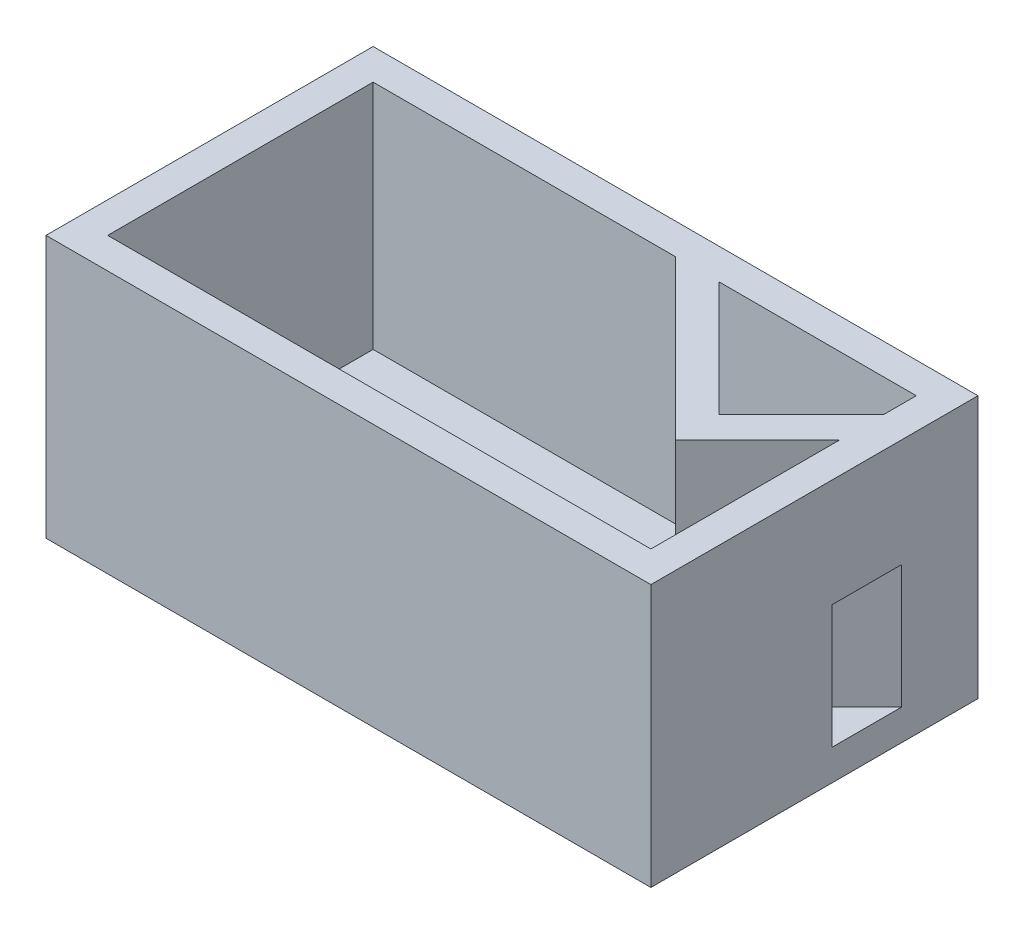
ISO-10303-21;
HEADER;
FILE_DESCRIPTION(('STEP AP214'),'2;1');
FILE_NAME('part.step','',(''),(''),'','','');
FILE_SCHEMA(('AUTOMOTIVE_DESIGN { 1 0 10303 214 1 1 1 1 }'));
ENDSEC;
DATA;
#1=APPLICATION_CONTEXT('core data for automotive mechanical design processes');
#2=APPLICATION_PROTOCOL_DEFINITION('international standard','automotive_design',2000,#1);
#3=PRODUCT_CONTEXT('',#1,'mechanical');
#4=PRODUCT('Part','Part','',(#3));
#5=PRODUCT_RELATED_PRODUCT_CATEGORY('part','',(#4));
#6=PRODUCT_DEFINITION_FORMATION('','',#4);
#7=PRODUCT_DEFINITION_CONTEXT('part definition',#1,'design');
#8=PRODUCT_DEFINITION('design','',#6,#7);
#9=PRODUCT_DEFINITION_SHAPE('','',#8);
#10=(LENGTH_UNIT() NAMED_UNIT(*) SI_UNIT(.MILLI.,.METRE.));
#11=(NAMED_UNIT(*) PLANE_ANGLE_UNIT() SI_UNIT($,.RADIAN.));
#12=(NAMED_UNIT(*) SI_UNIT($,.STERADIAN.) SOLID_ANGLE_UNIT());
#13=UNCERTAINTY_MEASURE_WITH_UNIT(LENGTH_MEASURE(1.E-05),#10,'distance_accuracy_value','');
#14=(GEOMETRIC_REPRESENTATION_CONTEXT(3) GLOBAL_UNCERTAINTY_ASSIGNED_CONTEXT((#13)) GLOBAL_UNIT_ASSIGNED_CONTEXT((#10,
#11,#12)) REPRESENTATION_CONTEXT('',''));
#15=CARTESIAN_POINT('',(0.,0.,0.));
#16=DIRECTION('',(0.,0.,1.));
#17=DIRECTION('',(1.,0.,0.));
#18=AXIS2_PLACEMENT_3D('',#15,#16,#17);
#19=CARTESIAN_POINT('',(4724.4,0.,2692.4));
#20=DIRECTION('',(-1.,0.,0.));
#21=DIRECTION('',(0.,0.,1.));
#22=AXIS2_PLACEMENT_3D('',#19,#20,#21);
#23=PLANE('',#22);
#24=DIRECTION('',(0.,-1.,0.));
#25=VECTOR('',#24,1.);
#26=CARTESIAN_POINT('',(4724.4,0.,882.591848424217));
#27=LINE('',#26,#25);
#28=CARTESIAN_POINT('',(4724.4,2159.,882.591848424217));
#29=VERTEX_POINT('',#28);
#30=CARTESIAN_POINT('',(4724.4,1270.,882.591848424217));
#31=VERTEX_POINT('',#30);
#32=EDGE_CURVE('E168',#29,#31,#27,.T.);
#33=ORIENTED_EDGE('',*,*,#32,.T.);
#34=DIRECTION('',(0.,0.,1.));
#35=VECTOR('',#34,1.);
#36=CARTESIAN_POINT('',(4724.4,1270.,2692.4));
#37=LINE('',#36,#35);
#38=CARTESIAN_POINT('',(4724.4,1270.,1457.32824017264));
#39=VERTEX_POINT('',#38);
#40=EDGE_CURVE('E159',#31,#39,#37,.T.);
#41=ORIENTED_EDGE('',*,*,#40,.T.);
#42=DIRECTION('',(0.,-1.,0.));
#43=VECTOR('',#42,1.);
#44=CARTESIAN_POINT('',(4724.4,2.69922264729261E-13,1457.32824017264));
#45=LINE('',#44,#43);
#46=CARTESIAN_POINT('',(4724.4,254.,1457.32824017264));
#47=VERTEX_POINT('',#46);
#48=EDGE_CURVE('E147',#39,#47,#45,.T.);
#49=ORIENTED_EDGE('',*,*,#48,.T.);
#50=DIRECTION('',(0.,0.,-1.));
#51=VECTOR('',#50,1.);
#52=CARTESIAN_POINT('',(4724.4,254.,2692.4));
#53=LINE('',#52,#51);
#54=CARTESIAN_POINT('',(4724.4,254.,2438.4));
#55=VERTEX_POINT('',#54);
#56=EDGE_CURVE('E212',#55,#47,#53,.T.);
#57=ORIENTED_EDGE('',*,*,#56,.F.);
#58=DIRECTION('',(0.,1.,0.));
#59=VECTOR('',#58,1.);
#60=CARTESIAN_POINT('',(4724.4,0.,2438.4));
#61=LINE('',#60,#59);
#62=CARTESIAN_POINT('',(4724.4,2159.,2438.4));
#63=VERTEX_POINT('',#62);
#64=EDGE_CURVE('E225',#55,#63,#61,.T.);
#65=ORIENTED_EDGE('',*,*,#64,.T.);
#66=DIRECTION('',(0.,0.,-1.));
#67=VECTOR('',#66,1.);
#68=CARTESIAN_POINT('',(4724.4,2159.,2692.4));
#69=LINE('',#68,#67);
#70=EDGE_CURVE('E238',#63,#29,#69,.T.);
#71=ORIENTED_EDGE('',*,*,#70,.T.);
#72=EDGE_LOOP('',(#33,#41,#49,#57,#65,#71));
#73=FACE_BOUND('',#72,.T.);
#74=ADVANCED_FACE('F32',(#73),#23,.T.);
#75=CARTESIAN_POINT('',(4978.4,0.,2692.4));
#76=DIRECTION('',(-1.,0.,0.));
#77=DIRECTION('',(0.,0.,1.));
#78=AXIS2_PLACEMENT_3D('',#75,#76,#77);
#79=PLANE('',#78);
#80=DIRECTION('',(0.,1.,0.));
#81=VECTOR('',#80,1.);
#82=CARTESIAN_POINT('',(4978.4,0.,0.));
#83=LINE('',#82,#81);
#84=CARTESIAN_POINT('',(4978.4,0.,0.));
#85=VERTEX_POINT('',#84);
#86=CARTESIAN_POINT('',(4978.4,2159.,0.));
#87=VERTEX_POINT('',#86);
#88=EDGE_CURVE('E256',#85,#87,#83,.T.);
#89=ORIENTED_EDGE('',*,*,#88,.T.);
#90=DIRECTION('',(0.,0.,-1.));
#91=VECTOR('',#90,1.);
#92=CARTESIAN_POINT('',(4978.4,2159.,2692.4));
#93=LINE('',#92,#91);
#94=CARTESIAN_POINT('',(4978.4,2159.,2692.4));
#95=VERTEX_POINT('',#94);
#96=EDGE_CURVE('E262',#95,#87,#93,.T.);
#97=ORIENTED_EDGE('',*,*,#96,.F.);
#98=DIRECTION('',(0.,1.,0.));
#99=VECTOR('',#98,1.);
#100=CARTESIAN_POINT('',(4978.4,0.,2692.4));
#101=LINE('',#100,#99);
#102=CARTESIAN_POINT('',(4978.4,0.,2692.4));
#103=VERTEX_POINT('',#102);
#104=EDGE_CURVE('E247',#103,#95,#101,.T.);
#105=ORIENTED_EDGE('',*,*,#104,.F.);
#106=DIRECTION('',(0.,0.,-1.));
#107=VECTOR('',#106,1.);
#108=CARTESIAN_POINT('',(4978.4,0.,2692.4));
#109=LINE('',#108,#107);
#110=EDGE_CURVE('E264',#103,#85,#109,.T.);
#111=ORIENTED_EDGE('',*,*,#110,.T.);
#112=EDGE_LOOP('',(#89,#97,#105,#111));
#113=FACE_BOUND('',#112,.T.);
#114=DIRECTION('',(0.,0.,-1.));
#115=VECTOR('',#114,1.);
#116=CARTESIAN_POINT('',(4978.4,254.,2692.4));
#117=LINE('',#116,#115);
#118=CARTESIAN_POINT('',(4978.4,254.,1203.32824017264));
#119=VERTEX_POINT('',#118);
#120=CARTESIAN_POINT('',(4978.4,254.,628.59184842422));
#121=VERTEX_POINT('',#120);
#122=EDGE_CURVE('E169',#119,#121,#117,.T.);
#123=ORIENTED_EDGE('',*,*,#122,.F.);
#124=DIRECTION('',(0.,-1.,0.));
#125=VECTOR('',#124,1.);
#126=CARTESIAN_POINT('',(4978.4,3.25433415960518E-13,1203.32824017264));
#127=LINE('',#126,#125);
#128=CARTESIAN_POINT('',(4978.4,1270.,1203.32824017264));
#129=VERTEX_POINT('',#128);
#130=EDGE_CURVE('E154',#129,#119,#127,.T.);
#131=ORIENTED_EDGE('',*,*,#130,.F.);
#132=DIRECTION('',(0.,0.,1.));
#133=VECTOR('',#132,1.);
#134=CARTESIAN_POINT('',(4978.4,1270.,2692.4));
#135=LINE('',#134,#133);
#136=CARTESIAN_POINT('',(4978.4,1270.,628.59184842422));
#137=VERTEX_POINT('',#136);
#138=EDGE_CURVE('E162',#137,#129,#135,.T.);
#139=ORIENTED_EDGE('',*,*,#138,.F.);
#140=DIRECTION('',(0.,1.,0.));
#141=VECTOR('',#140,1.);
#142=CARTESIAN_POINT('',(4978.4,0.,628.591848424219));
#143=LINE('',#142,#141);
#144=EDGE_CURVE('E172',#121,#137,#143,.T.);
#145=ORIENTED_EDGE('',*,*,#144,.F.);
#146=EDGE_LOOP('',(#123,#131,#139,#145));
#147=FACE_BOUND('',#146,.T.);
#148=ADVANCED_FACE('F305',(#113,#147),#79,.F.);
#149=CARTESIAN_POINT('',(0.,254.,2692.4));
#150=DIRECTION('',(0.,1.,0.));
#151=DIRECTION('',(0.,0.,1.));
#152=AXIS2_PLACEMENT_3D('',#149,#150,#151);
#153=PLANE('',#152);
#154=DIRECTION('',(-0.707106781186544,0.,-0.707106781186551));
#155=VECTOR('',#154,1.);
#156=CARTESIAN_POINT('',(2769.50256121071,254.,-77.1025612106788));
#157=LINE('',#156,#155);
#158=CARTESIAN_POINT('',(4047.19336300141,254.,1200.58824058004));
#159=VERTEX_POINT('',#158);
#160=CARTESIAN_POINT('',(3100.60512242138,254.,254.));
#161=VERTEX_POINT('',#160);
#162=EDGE_CURVE('E196',#159,#161,#157,.T.);
#163=ORIENTED_EDGE('',*,*,#162,.F.);
#164=DIRECTION('',(-0.707106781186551,0.,0.707106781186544));
#165=VECTOR('',#164,1.);
#166=CARTESIAN_POINT('',(1277.6908017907,254.,3970.09080179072));
#167=LINE('',#166,#165);
#168=CARTESIAN_POINT('',(4724.4,254.,523.381603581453));
#169=VERTEX_POINT('',#168);
#170=EDGE_CURVE('E11',#169,#159,#167,.T.);
#171=ORIENTED_EDGE('',*,*,#170,.F.);
#172=CARTESIAN_POINT('',(4724.4,254.,254.));
#173=VERTEX_POINT('',#172);
#174=EDGE_CURVE('E223',#169,#173,#53,.T.);
#175=ORIENTED_EDGE('',*,*,#174,.T.);
#176=DIRECTION('',(1.,0.,0.));
#177=VECTOR('',#176,1.);
#178=CARTESIAN_POINT('',(0.,254.,254.));
#179=LINE('',#178,#177);
#180=EDGE_CURVE('E207',#161,#173,#179,.T.);
#181=ORIENTED_EDGE('',*,*,#180,.F.);
#182=EDGE_LOOP('',(#163,#171,#175,#181));
#183=FACE_BOUND('',#182,.T.);
#184=ADVANCED_FACE('F322',(#183),#153,.T.);
#185=CARTESIAN_POINT('',(0.,0.,254.));
#186=DIRECTION('',(0.,0.,-1.));
#187=DIRECTION('',(-1.,0.,0.));
#188=AXIS2_PLACEMENT_3D('',#185,#186,#187);
#189=PLANE('',#188);
#190=DIRECTION('',(-1.,0.,0.));
#191=VECTOR('',#190,1.);
#192=CARTESIAN_POINT('',(0.,2159.,254.));
#193=LINE('',#192,#191);
#194=CARTESIAN_POINT('',(4724.4,2159.,254.));
#195=VERTEX_POINT('',#194);
#196=CARTESIAN_POINT('',(3100.60512242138,2159.,254.));
#197=VERTEX_POINT('',#196);
#198=EDGE_CURVE('E217',#195,#197,#193,.T.);
#199=ORIENTED_EDGE('',*,*,#198,.T.);
#200=DIRECTION('',(0.,-1.,0.));
#201=VECTOR('',#200,1.);
#202=CARTESIAN_POINT('',(3100.60512242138,0.,254.));
#203=LINE('',#202,#201);
#204=EDGE_CURVE('E273',#197,#161,#203,.T.);
#205=ORIENTED_EDGE('',*,*,#204,.T.);
#206=ORIENTED_EDGE('',*,*,#180,.T.);
#207=DIRECTION('',(0.,1.,0.));
#208=VECTOR('',#207,1.);
#209=CARTESIAN_POINT('',(4724.4,0.,254.));
#210=LINE('',#209,#208);
#211=EDGE_CURVE('E221',#173,#195,#210,.T.);
#212=ORIENTED_EDGE('',*,*,#211,.T.);
#213=EDGE_LOOP('',(#199,#205,#206,#212));
#214=FACE_BOUND('',#213,.T.);
#215=ADVANCED_FACE('F353',(#214),#189,.F.);
#216=CARTESIAN_POINT('',(0.,2159.,2692.4));
#217=DIRECTION('',(0.,-1.,0.));
#218=DIRECTION('',(0.,0.,-1.));
#219=AXIS2_PLACEMENT_3D('',#216,#217,#218);
#220=PLANE('',#219);
#221=CARTESIAN_POINT('',(4724.4,2159.,523.381603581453));
#222=VERTEX_POINT('',#221);
#223=EDGE_CURVE('E235',#222,#195,#69,.T.);
#224=ORIENTED_EDGE('',*,*,#223,.F.);
#225=DIRECTION('',(-0.707106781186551,0.,0.707106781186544));
#226=VECTOR('',#225,1.);
#227=CARTESIAN_POINT('',(3957.39080179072,2159.,1290.39080179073));
#228=LINE('',#227,#226);
#229=CARTESIAN_POINT('',(4047.19336300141,2159.,1200.58824058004));
#230=VERTEX_POINT('',#229);
#231=EDGE_CURVE('E182',#230,#222,#228,.F.);
#232=ORIENTED_EDGE('',*,*,#231,.F.);
#233=DIRECTION('',(-0.707106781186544,0.,-0.707106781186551));
#234=VECTOR('',#233,1.);
#235=CARTESIAN_POINT('',(3010.80256121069,2159.,164.197438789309));
#236=LINE('',#235,#234);
#237=EDGE_CURVE('E187',#197,#230,#236,.F.);
#238=ORIENTED_EDGE('',*,*,#237,.F.);
#239=ORIENTED_EDGE('',*,*,#198,.F.);
#240=EDGE_LOOP('',(#224,#232,#238,#239));
#241=FACE_BOUND('',#240,.T.);
#242=DIRECTION('',(-1.,0.,0.));
#243=VECTOR('',#242,1.);
#244=CARTESIAN_POINT('',(0.,2159.,0.));
#245=LINE('',#244,#243);
#246=CARTESIAN_POINT('',(0.,2159.,0.));
#247=VERTEX_POINT('',#246);
#248=EDGE_CURVE('E245',#87,#247,#245,.T.);
#249=ORIENTED_EDGE('',*,*,#248,.T.);
#250=DIRECTION('',(0.,0.,-1.));
#251=VECTOR('',#250,1.);
#252=CARTESIAN_POINT('',(0.,2159.,2692.4));
#253=LINE('',#252,#251);
#254=CARTESIAN_POINT('',(0.,2159.,2692.4));
#255=VERTEX_POINT('',#254);
#256=EDGE_CURVE('E251',#255,#247,#253,.T.);
#257=ORIENTED_EDGE('',*,*,#256,.F.);
#258=DIRECTION('',(-1.,0.,0.));
#259=VECTOR('',#258,1.);
#260=CARTESIAN_POINT('',(0.,2159.,2692.4));
#261=LINE('',#260,#259);
#262=EDGE_CURVE('E249',#95,#255,#261,.T.);
#263=ORIENTED_EDGE('',*,*,#262,.F.);
#264=ORIENTED_EDGE('',*,*,#96,.T.);
#265=EDGE_LOOP('',(#249,#257,#263,#264));
#266=FACE_BOUND('',#265,.T.);
#267=DIRECTION('',(-0.707106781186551,0.,0.707106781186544));
#268=VECTOR('',#267,1.);
#269=CARTESIAN_POINT('',(4136.9959242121,2159.,1469.99592421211));
#270=LINE('',#269,#268);
#271=CARTESIAN_POINT('',(4047.19336300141,2159.,1559.7984854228));
#272=VERTEX_POINT('',#271);
#273=EDGE_CURVE('E293',#272,#29,#270,.F.);
#274=ORIENTED_EDGE('',*,*,#273,.T.);
#275=ORIENTED_EDGE('',*,*,#70,.F.);
#276=DIRECTION('',(-1.,0.,0.));
#277=VECTOR('',#276,1.);
#278=CARTESIAN_POINT('',(0.,2159.,2438.4));
#279=LINE('',#278,#277);
#280=CARTESIAN_POINT('',(254.,2159.,2438.4));
#281=VERTEX_POINT('',#280);
#282=EDGE_CURVE('E231',#63,#281,#279,.T.);
#283=ORIENTED_EDGE('',*,*,#282,.T.);
#284=DIRECTION('',(0.,0.,-1.));
#285=VECTOR('',#284,1.);
#286=CARTESIAN_POINT('',(254.,2159.,2692.4));
#287=LINE('',#286,#285);
#288=CARTESIAN_POINT('',(254.,2159.,254.));
#289=VERTEX_POINT('',#288);
#290=EDGE_CURVE('E232',#281,#289,#287,.T.);
#291=ORIENTED_EDGE('',*,*,#290,.T.);
#292=CARTESIAN_POINT('',(2741.39487757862,2159.,254.));
#293=VERTEX_POINT('',#292);
#294=EDGE_CURVE('E228',#293,#289,#193,.T.);
#295=ORIENTED_EDGE('',*,*,#294,.F.);
#296=DIRECTION('',(-0.707106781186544,0.,-0.707106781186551));
#297=VECTOR('',#296,1.);
#298=CARTESIAN_POINT('',(2831.19743878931,2159.,343.802561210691));
#299=LINE('',#298,#297);
#300=EDGE_CURVE('E183',#293,#272,#299,.F.);
#301=ORIENTED_EDGE('',*,*,#300,.T.);
#302=EDGE_LOOP('',(#274,#275,#283,#291,#295,#301));
#303=FACE_BOUND('',#302,.T.);
#304=ADVANCED_FACE('F310',(#241,#266,#303),#220,.F.);
#305=CARTESIAN_POINT('',(0.,0.,2692.4));
#306=DIRECTION('',(1.,0.,0.));
#307=DIRECTION('',(0.,0.,-1.));
#308=AXIS2_PLACEMENT_3D('',#305,#306,#307);
#309=PLANE('',#308);
#310=DIRECTION('',(0.,-1.,0.));
#311=VECTOR('',#310,1.);
#312=CARTESIAN_POINT('',(0.,0.,0.));
#313=LINE('',#312,#311);
#314=CARTESIAN_POINT('',(0.,0.,0.));
#315=VERTEX_POINT('',#314);
#316=EDGE_CURVE('E211',#247,#315,#313,.T.);
#317=ORIENTED_EDGE('',*,*,#316,.T.);
#318=DIRECTION('',(0.,0.,-1.));
#319=VECTOR('',#318,1.);
#320=CARTESIAN_POINT('',(0.,0.,2692.4));
#321=LINE('',#320,#319);
#322=CARTESIAN_POINT('',(0.,0.,2692.4));
#323=VERTEX_POINT('',#322);
#324=EDGE_CURVE('E267',#323,#315,#321,.T.);
#325=ORIENTED_EDGE('',*,*,#324,.F.);
#326=DIRECTION('',(0.,-1.,0.));
#327=VECTOR('',#326,1.);
#328=CARTESIAN_POINT('',(0.,0.,2692.4));
#329=LINE('',#328,#327);
#330=EDGE_CURVE('E241',#255,#323,#329,.T.);
#331=ORIENTED_EDGE('',*,*,#330,.F.);
#332=ORIENTED_EDGE('',*,*,#256,.T.);
#333=EDGE_LOOP('',(#317,#325,#331,#332));
#334=FACE_BOUND('',#333,.T.);
#335=ADVANCED_FACE('F34',(#334),#309,.F.);
#336=CARTESIAN_POINT('',(0.,0.,2692.4));
#337=DIRECTION('',(0.,1.,0.));
#338=DIRECTION('',(0.,0.,1.));
#339=AXIS2_PLACEMENT_3D('',#336,#337,#338);
#340=PLANE('',#339);
#341=DIRECTION('',(1.,0.,0.));
#342=VECTOR('',#341,1.);
#343=CARTESIAN_POINT('',(0.,0.,0.));
#344=LINE('',#343,#342);
#345=EDGE_CURVE('E254',#315,#85,#344,.T.);
#346=ORIENTED_EDGE('',*,*,#345,.T.);
#347=ORIENTED_EDGE('',*,*,#110,.F.);
#348=DIRECTION('',(1.,0.,0.));
#349=VECTOR('',#348,1.);
#350=CARTESIAN_POINT('',(0.,0.,2692.4));
#351=LINE('',#350,#349);
#352=EDGE_CURVE('E244',#323,#103,#351,.T.);
#353=ORIENTED_EDGE('',*,*,#352,.F.);
#354=ORIENTED_EDGE('',*,*,#324,.T.);
#355=EDGE_LOOP('',(#346,#347,#353,#354));
#356=FACE_BOUND('',#355,.T.);
#357=ADVANCED_FACE('F453',(#356),#340,.F.);
#358=CARTESIAN_POINT('',(0.,0.,2692.4));
#359=DIRECTION('',(0.,0.,-1.));
#360=DIRECTION('',(-1.,0.,0.));
#361=AXIS2_PLACEMENT_3D('',#358,#359,#360);
#362=PLANE('',#361);
#363=ORIENTED_EDGE('',*,*,#330,.T.);
#364=ORIENTED_EDGE('',*,*,#352,.T.);
#365=ORIENTED_EDGE('',*,*,#104,.T.);
#366=ORIENTED_EDGE('',*,*,#262,.T.);
#367=EDGE_LOOP('',(#363,#364,#365,#366));
#368=FACE_BOUND('',#367,.T.);
#369=ADVANCED_FACE('F323',(#368),#362,.F.);
#370=CARTESIAN_POINT('',(0.,0.,0.));
#371=DIRECTION('',(0.,0.,-1.));
#372=DIRECTION('',(-1.,0.,0.));
#373=AXIS2_PLACEMENT_3D('',#370,#371,#372);
#374=PLANE('',#373);
#375=ORIENTED_EDGE('',*,*,#316,.F.);
#376=ORIENTED_EDGE('',*,*,#248,.F.);
#377=ORIENTED_EDGE('',*,*,#88,.F.);
#378=ORIENTED_EDGE('',*,*,#345,.F.);
#379=EDGE_LOOP('',(#375,#376,#377,#378));
#380=FACE_BOUND('',#379,.T.);
#381=ADVANCED_FACE('F314',(#380),#374,.T.);
#382=CARTESIAN_POINT('',(254.,0.,2692.4));
#383=DIRECTION('',(1.,0.,0.));
#384=DIRECTION('',(0.,0.,-1.));
#385=AXIS2_PLACEMENT_3D('',#382,#383,#384);
#386=PLANE('',#385);
#387=DIRECTION('',(0.,-1.,0.));
#388=VECTOR('',#387,1.);
#389=CARTESIAN_POINT('',(254.,0.,254.));
#390=LINE('',#389,#388);
#391=CARTESIAN_POINT('',(254.,254.,254.));
#392=VERTEX_POINT('',#391);
#393=EDGE_CURVE('E204',#289,#392,#390,.T.);
#394=ORIENTED_EDGE('',*,*,#393,.F.);
#395=ORIENTED_EDGE('',*,*,#290,.F.);
#396=DIRECTION('',(0.,-1.,0.));
#397=VECTOR('',#396,1.);
#398=CARTESIAN_POINT('',(254.,0.,2438.4));
#399=LINE('',#398,#397);
#400=CARTESIAN_POINT('',(254.,254.,2438.4));
#401=VERTEX_POINT('',#400);
#402=EDGE_CURVE('E213',#281,#401,#399,.T.);
#403=ORIENTED_EDGE('',*,*,#402,.T.);
#404=DIRECTION('',(0.,0.,-1.));
#405=VECTOR('',#404,1.);
#406=CARTESIAN_POINT('',(254.,254.,2692.4));
#407=LINE('',#406,#405);
#408=EDGE_CURVE('E208',#401,#392,#407,.T.);
#409=ORIENTED_EDGE('',*,*,#408,.T.);
#410=EDGE_LOOP('',(#394,#395,#403,#409));
#411=FACE_BOUND('',#410,.T.);
#412=ADVANCED_FACE('F312',(#411),#386,.T.);
#413=ORIENTED_EDGE('',*,*,#56,.T.);
#414=DIRECTION('',(-0.707106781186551,0.,0.707106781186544));
#415=VECTOR('',#414,1.);
#416=CARTESIAN_POINT('',(5580.06412008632,254.,601.664120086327));
#417=LINE('',#416,#415);
#418=EDGE_CURVE('E52',#119,#47,#417,.T.);
#419=ORIENTED_EDGE('',*,*,#418,.F.);
#420=ORIENTED_EDGE('',*,*,#122,.T.);
#421=DIRECTION('',(-0.707106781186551,0.,0.707106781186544));
#422=VECTOR('',#421,1.);
#423=CARTESIAN_POINT('',(1457.29592421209,254.,4149.6959242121));
#424=LINE('',#423,#422);
#425=CARTESIAN_POINT('',(4047.19336300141,254.,1559.7984854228));
#426=VERTEX_POINT('',#425);
#427=EDGE_CURVE('E201',#121,#426,#424,.T.);
#428=ORIENTED_EDGE('',*,*,#427,.T.);
#429=DIRECTION('',(-0.707106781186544,0.,-0.707106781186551));
#430=VECTOR('',#429,1.);
#431=CARTESIAN_POINT('',(2589.89743878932,254.,102.502561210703));
#432=LINE('',#431,#430);
#433=CARTESIAN_POINT('',(2741.39487757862,254.,254.));
#434=VERTEX_POINT('',#433);
#435=EDGE_CURVE('E40',#426,#434,#432,.T.);
#436=ORIENTED_EDGE('',*,*,#435,.T.);
#437=EDGE_CURVE('E218',#392,#434,#179,.T.);
#438=ORIENTED_EDGE('',*,*,#437,.F.);
#439=ORIENTED_EDGE('',*,*,#408,.F.);
#440=DIRECTION('',(1.,0.,0.));
#441=VECTOR('',#440,1.);
#442=CARTESIAN_POINT('',(0.,254.,2438.4));
#443=LINE('',#442,#441);
#444=EDGE_CURVE('E216',#401,#55,#443,.T.);
#445=ORIENTED_EDGE('',*,*,#444,.T.);
#446=EDGE_LOOP('',(#413,#419,#420,#428,#436,#438,#439,#445));
#447=FACE_BOUND('',#446,.T.);
#448=ADVANCED_FACE('F280',(#447),#153,.T.);
#449=DIRECTION('',(0.,-1.,0.));
#450=VECTOR('',#449,1.);
#451=CARTESIAN_POINT('',(4724.4,0.,523.381603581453));
#452=LINE('',#451,#450);
#453=EDGE_CURVE('E276',#222,#169,#452,.T.);
#454=ORIENTED_EDGE('',*,*,#453,.F.);
#455=ORIENTED_EDGE('',*,*,#223,.T.);
#456=ORIENTED_EDGE('',*,*,#211,.F.);
#457=ORIENTED_EDGE('',*,*,#174,.F.);
#458=EDGE_LOOP('',(#454,#455,#456,#457));
#459=FACE_BOUND('',#458,.T.);
#460=ADVANCED_FACE('F320',(#459),#23,.T.);
#461=CARTESIAN_POINT('',(0.,0.,2438.4));
#462=DIRECTION('',(0.,0.,-1.));
#463=DIRECTION('',(-1.,0.,0.));
#464=AXIS2_PLACEMENT_3D('',#461,#462,#463);
#465=PLANE('',#464);
#466=ORIENTED_EDGE('',*,*,#402,.F.);
#467=ORIENTED_EDGE('',*,*,#282,.F.);
#468=ORIENTED_EDGE('',*,*,#64,.F.);
#469=ORIENTED_EDGE('',*,*,#444,.F.);
#470=EDGE_LOOP('',(#466,#467,#468,#469));
#471=FACE_BOUND('',#470,.T.);
#472=ADVANCED_FACE('F309',(#471),#465,.T.);
#473=ORIENTED_EDGE('',*,*,#437,.T.);
#474=DIRECTION('',(0.,1.,0.));
#475=VECTOR('',#474,1.);
#476=CARTESIAN_POINT('',(2741.39487757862,0.,254.));
#477=LINE('',#476,#475);
#478=EDGE_CURVE('E270',#434,#293,#477,.T.);
#479=ORIENTED_EDGE('',*,*,#478,.T.);
#480=ORIENTED_EDGE('',*,*,#294,.T.);
#481=ORIENTED_EDGE('',*,*,#393,.T.);
#482=EDGE_LOOP('',(#473,#479,#480,#481));
#483=FACE_BOUND('',#482,.T.);
#484=ADVANCED_FACE('F285',(#483),#189,.F.);
#485=CARTESIAN_POINT('',(3010.80256121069,2159.,164.197438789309));
#486=DIRECTION('',(0.707106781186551,0.,-0.707106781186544));
#487=DIRECTION('',(-0.707106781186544,0.,-0.707106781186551));
#488=AXIS2_PLACEMENT_3D('',#485,#486,#487);
#489=PLANE('',#488);
#490=DIRECTION('',(0.,-1.,0.));
#491=VECTOR('',#490,1.);
#492=CARTESIAN_POINT('',(4047.19336300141,2159.,1200.58824058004));
#493=LINE('',#492,#491);
#494=EDGE_CURVE('E179',#230,#159,#493,.T.);
#495=ORIENTED_EDGE('',*,*,#494,.T.);
#496=ORIENTED_EDGE('',*,*,#162,.T.);
#497=ORIENTED_EDGE('',*,*,#204,.F.);
#498=ORIENTED_EDGE('',*,*,#237,.T.);
#499=EDGE_LOOP('',(#495,#496,#497,#498));
#500=FACE_BOUND('',#499,.T.);
#501=ADVANCED_FACE('F357',(#500),#489,.T.);
#502=CARTESIAN_POINT('',(3957.39080179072,2159.,1290.39080179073));
#503=DIRECTION('',(-0.707106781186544,0.,-0.707106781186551));
#504=DIRECTION('',(-0.707106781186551,0.,0.707106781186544));
#505=AXIS2_PLACEMENT_3D('',#502,#503,#504);
#506=PLANE('',#505);
#507=ORIENTED_EDGE('',*,*,#231,.T.);
#508=ORIENTED_EDGE('',*,*,#453,.T.);
#509=ORIENTED_EDGE('',*,*,#170,.T.);
#510=ORIENTED_EDGE('',*,*,#494,.F.);
#511=EDGE_LOOP('',(#507,#508,#509,#510));
#512=FACE_BOUND('',#511,.T.);
#513=ADVANCED_FACE('F359',(#512),#506,.T.);
#514=CARTESIAN_POINT('',(2831.19743878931,2159.,343.802561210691));
#515=DIRECTION('',(-0.707106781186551,0.,0.707106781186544));
#516=DIRECTION('',(0.707106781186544,0.,0.707106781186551));
#517=AXIS2_PLACEMENT_3D('',#514,#515,#516);
#518=PLANE('',#517);
#519=ORIENTED_EDGE('',*,*,#478,.F.);
#520=ORIENTED_EDGE('',*,*,#435,.F.);
#521=DIRECTION('',(0.,-1.,0.));
#522=VECTOR('',#521,1.);
#523=CARTESIAN_POINT('',(4047.19336300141,2159.,1559.7984854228));
#524=LINE('',#523,#522);
#525=EDGE_CURVE('E153',#272,#426,#524,.T.);
#526=ORIENTED_EDGE('',*,*,#525,.F.);
#527=ORIENTED_EDGE('',*,*,#300,.F.);
#528=EDGE_LOOP('',(#519,#520,#526,#527));
#529=FACE_BOUND('',#528,.T.);
#530=ADVANCED_FACE('F288',(#529),#518,.T.);
#531=CARTESIAN_POINT('',(4136.9959242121,2159.,1469.99592421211));
#532=DIRECTION('',(-0.707106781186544,0.,-0.707106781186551));
#533=DIRECTION('',(-0.707106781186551,0.,0.707106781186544));
#534=AXIS2_PLACEMENT_3D('',#531,#532,#533);
#535=PLANE('',#534);
#536=ORIENTED_EDGE('',*,*,#427,.F.);
#537=ORIENTED_EDGE('',*,*,#144,.T.);
#538=DIRECTION('',(-0.707106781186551,0.,0.707106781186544));
#539=VECTOR('',#538,1.);
#540=CARTESIAN_POINT('',(5292.69592421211,1270.,314.295924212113));
#541=LINE('',#540,#539);
#542=EDGE_CURVE('E164',#137,#31,#541,.T.);
#543=ORIENTED_EDGE('',*,*,#542,.T.);
#544=ORIENTED_EDGE('',*,*,#32,.F.);
#545=ORIENTED_EDGE('',*,*,#273,.F.);
#546=ORIENTED_EDGE('',*,*,#525,.T.);
#547=EDGE_LOOP('',(#536,#537,#543,#544,#545,#546));
#548=FACE_BOUND('',#547,.T.);
#549=ADVANCED_FACE('F300',(#548),#535,.F.);
#550=CARTESIAN_POINT('',(5580.06412008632,1270.,601.664120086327));
#551=DIRECTION('',(-0.707106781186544,0.,-0.707106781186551));
#552=DIRECTION('',(-0.707106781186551,0.,0.707106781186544));
#553=AXIS2_PLACEMENT_3D('',#550,#551,#552);
#554=PLANE('',#553);
#555=DIRECTION('',(-0.707106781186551,0.,0.707106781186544));
#556=VECTOR('',#555,1.);
#557=CARTESIAN_POINT('',(5580.06412008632,1270.,601.664120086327));
#558=LINE('',#557,#556);
#559=EDGE_CURVE('E47',#129,#39,#558,.T.);
#560=ORIENTED_EDGE('',*,*,#559,.F.);
#561=ORIENTED_EDGE('',*,*,#130,.T.);
#562=ORIENTED_EDGE('',*,*,#418,.T.);
#563=ORIENTED_EDGE('',*,*,#48,.F.);
#564=EDGE_LOOP('',(#560,#561,#562,#563));
#565=FACE_BOUND('',#564,.T.);
#566=ADVANCED_FACE('F148',(#565),#554,.T.);
#567=CARTESIAN_POINT('',(5292.69592421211,1270.,314.295924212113));
#568=DIRECTION('',(0.,-1.,0.));
#569=DIRECTION('',(0.,0.,-1.));
#570=AXIS2_PLACEMENT_3D('',#567,#568,#569);
#571=PLANE('',#570);
#572=ORIENTED_EDGE('',*,*,#542,.F.);
#573=ORIENTED_EDGE('',*,*,#138,.T.);
#574=ORIENTED_EDGE('',*,*,#559,.T.);
#575=ORIENTED_EDGE('',*,*,#40,.F.);
#576=EDGE_LOOP('',(#572,#573,#574,#575));
#577=FACE_BOUND('',#576,.T.);
#578=ADVANCED_FACE('F158',(#577),#571,.T.);
#579=CLOSED_SHELL('',(#74,#148,#184,#215,#304,#335,#357,#369,#381,#412,#448,#460,#472,#484,#501,
#513,#530,#549,#566,#578));
#580=MANIFOLD_SOLID_BREP('B2',#579);
#581=ADVANCED_BREP_SHAPE_REPRESENTATION('',(#18,#580),#14);
#582=SHAPE_DEFINITION_REPRESENTATION(#9,#581);
ENDSEC;
END-ISO-10303-21;
